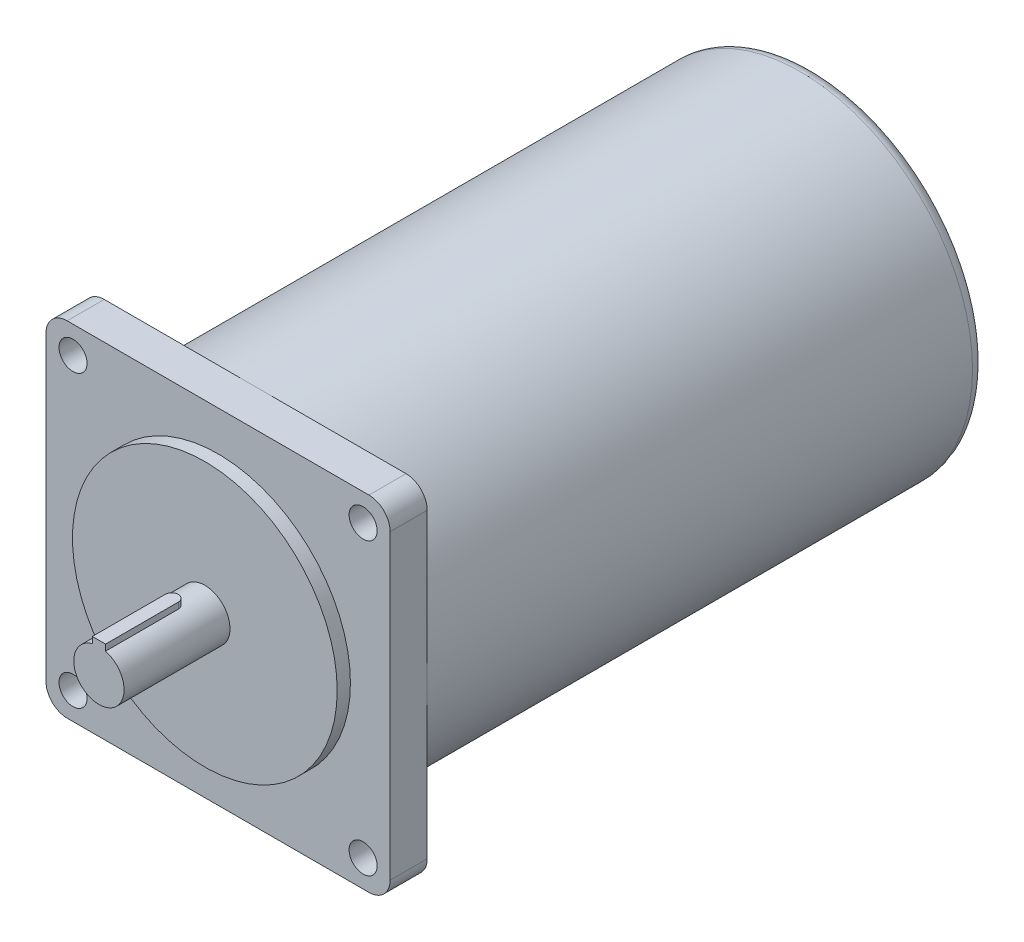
from build123d import *

# Parameters (mm, degrees)
SKETCH_1_R      = 50
EXTRUDE_1_DEPTH = 5
SKETCH_2_R      = 9.5
EXTRUDE_2_DEPTH = 40
EXTRUDE_3_DEPTH = 11.5
SKETCH_4_R      = 5.3
EXTRUDE_4_DEPTH = 14
SKETCH_6_R      = 65
EXTRUDE_5_DEPTH = 211
FILLET_1_R      = 5


with BuildPart() as part:
    # Sketch 1 → Extrude 1 (new body)
    with BuildSketch(Plane.XY):
        Circle(SKETCH_1_R)
    extrude(amount=-EXTRUDE_1_DEPTH)

    # Sketch 2 → Extrude 2 (add)
    with BuildSketch(Plane.XY):
        Circle(SKETCH_2_R)
    extrude(amount=EXTRUDE_2_DEPTH)

    # Sketch 3 → Extrude 3 (add)
    with BuildSketch(Plane(origin=(0, 0, 0), x_dir=(1, 0, 0), z_dir=(0, 1, 0))):
        with BuildLine():
            Line((-2.5, -12.5), (-2.5, -40))
            Line((-2.5, -40), (2.5, -40))
            Line((2.5, -40), (2.5, -12.5))
            ThreePointArc((2.5, -12.5), (0, -10), (-2.5, -12.5))
        make_face()
    extrude(amount=EXTRUDE_3_DEPTH)

    # Sketch 4 → Extrude 4 (add)
    with BuildSketch(Plane(origin=(0, 0, -5), x_dir=(-1, 0, 0), z_dir=(0, 0, -1))):
        with BuildLine():
            Line((0, 65), (57, 65))
            ThreePointArc((57, 65), (62.656854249, 62.656854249), (65, 57))
            Line((65, 57), (65, -57))
            ThreePointArc((65, -57), (62.656854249, -62.656854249), (57, -65))
            Line((57, -65), (-57, -65))
            ThreePointArc((-57, -65), (-62.656854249, -62.656854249), (-65, -57))
            Line((-65, -57), (-65, 57))
            ThreePointArc((-65, 57), (-62.656854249, 62.656854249), (-57, 65))
            Line((-57, 65), (0, 65))
        make_face()
        with Locations((-54.8, 54.8)):
            Circle(SKETCH_4_R, mode=Mode.SUBTRACT)
        with Locations((54.8, 54.8)):
            Circle(SKETCH_4_R, mode=Mode.SUBTRACT)
        with Locations((54.8, -54.8)):
            Circle(SKETCH_4_R, mode=Mode.SUBTRACT)
        with Locations((-54.8, -54.8)):
            Circle(SKETCH_4_R, mode=Mode.SUBTRACT)
    extrude(amount=EXTRUDE_4_DEPTH)

    # Sketch 6 → Extrude 5 (add)
    with BuildSketch(Plane(origin=(0, 0, -19), x_dir=(-1, 0, 0), z_dir=(0, 0, -1))):
        Circle(SKETCH_6_R)
    extrude(amount=EXTRUDE_5_DEPTH)

    # Fillet 1
    fillet_1_edges = [part.edges().sort_by_distance(p)[0] for p in [
        (65, 0, -230),
    ]]
    fillet(fillet_1_edges, radius=FILLET_1_R)


solid = part.part
